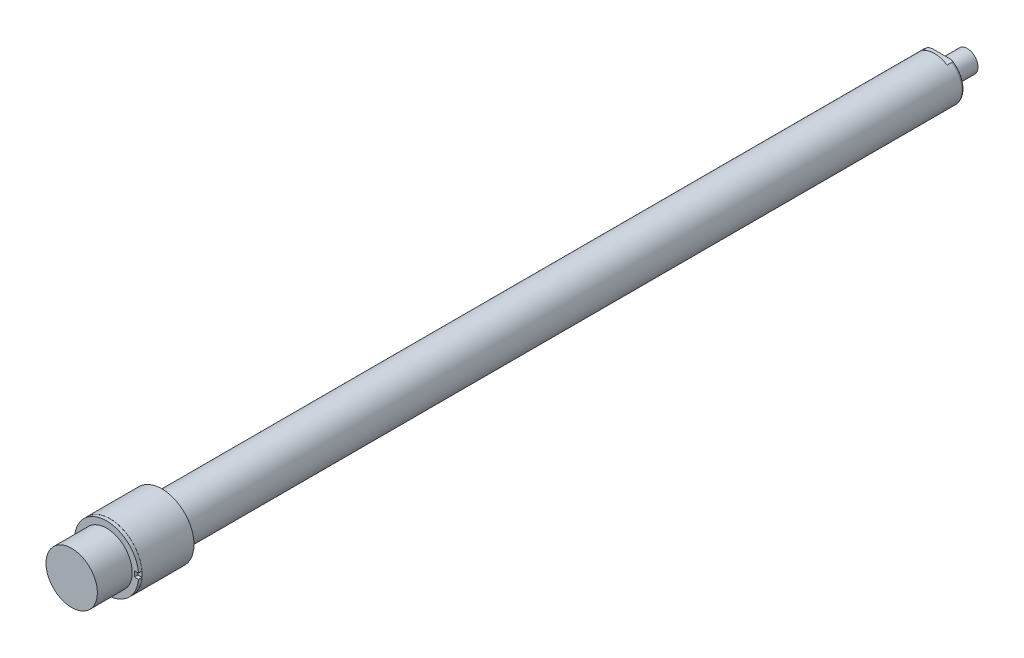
ISO-10303-21;
HEADER;
FILE_DESCRIPTION(('STEP AP214'),'2;1');
FILE_NAME('part.step','',(''),(''),'','','');
FILE_SCHEMA(('AUTOMOTIVE_DESIGN { 1 0 10303 214 1 1 1 1 }'));
ENDSEC;
DATA;
#1=APPLICATION_CONTEXT('core data for automotive mechanical design processes');
#2=APPLICATION_PROTOCOL_DEFINITION('international standard','automotive_design',2000,#1);
#3=PRODUCT_CONTEXT('',#1,'mechanical');
#4=PRODUCT('Part','Part','',(#3));
#5=PRODUCT_RELATED_PRODUCT_CATEGORY('part','',(#4));
#6=PRODUCT_DEFINITION_FORMATION('','',#4);
#7=PRODUCT_DEFINITION_CONTEXT('part definition',#1,'design');
#8=PRODUCT_DEFINITION('design','',#6,#7);
#9=PRODUCT_DEFINITION_SHAPE('','',#8);
#10=(LENGTH_UNIT() NAMED_UNIT(*) SI_UNIT(.MILLI.,.METRE.));
#11=(NAMED_UNIT(*) PLANE_ANGLE_UNIT() SI_UNIT($,.RADIAN.));
#12=(NAMED_UNIT(*) SI_UNIT($,.STERADIAN.) SOLID_ANGLE_UNIT());
#13=UNCERTAINTY_MEASURE_WITH_UNIT(LENGTH_MEASURE(1.E-05),#10,'distance_accuracy_value','');
#14=(GEOMETRIC_REPRESENTATION_CONTEXT(3) GLOBAL_UNCERTAINTY_ASSIGNED_CONTEXT((#13)) GLOBAL_UNIT_ASSIGNED_CONTEXT((#10,
#11,#12)) REPRESENTATION_CONTEXT('',''));
#15=CARTESIAN_POINT('',(0.,0.,0.));
#16=DIRECTION('',(0.,0.,1.));
#17=DIRECTION('',(1.,0.,0.));
#18=AXIS2_PLACEMENT_3D('',#15,#16,#17);
#19=CARTESIAN_POINT('',(-22.733,-2.032,13.0556));
#20=DIRECTION('',(0.,-1.,0.));
#21=DIRECTION('',(-1.,0.,0.));
#22=AXIS2_PLACEMENT_3D('',#19,#20,#21);
#23=PLANE('',#22);
#24=DIRECTION('',(1.,0.,0.));
#25=VECTOR('',#24,1.);
#26=CARTESIAN_POINT('',(0.,-2.032,10.6426));
#27=LINE('',#26,#25);
#28=CARTESIAN_POINT('',(-23.6236693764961,-2.032,10.6426));
#29=VERTEX_POINT('',#28);
#30=CARTESIAN_POINT('',(-20.574,-2.032,10.6426));
#31=VERTEX_POINT('',#30);
#32=EDGE_CURVE('E10',#29,#31,#27,.T.);
#33=ORIENTED_EDGE('',*,*,#32,.F.);
#34=DIRECTION('',(0.,0.,-1.));
#35=VECTOR('',#34,1.);
#36=CARTESIAN_POINT('',(-23.6236693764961,-2.032,13.182599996));
#37=LINE('',#36,#35);
#38=CARTESIAN_POINT('',(-23.6236693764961,-2.032,13.182599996));
#39=VERTEX_POINT('',#38);
#40=EDGE_CURVE('E296',#39,#29,#37,.T.);
#41=ORIENTED_EDGE('',*,*,#40,.F.);
#42=DIRECTION('',(-1.,0.,0.));
#43=VECTOR('',#42,1.);
#44=CARTESIAN_POINT('',(-20.574,-2.032,13.182599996));
#45=LINE('',#44,#43);
#46=CARTESIAN_POINT('',(-20.574,-2.032,13.182599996));
#47=VERTEX_POINT('',#46);
#48=EDGE_CURVE('E325',#47,#39,#45,.T.);
#49=ORIENTED_EDGE('',*,*,#48,.F.);
#50=DIRECTION('',(0.,0.,-1.));
#51=VECTOR('',#50,1.);
#52=CARTESIAN_POINT('',(-20.574,-2.032,13.0556));
#53=LINE('',#52,#51);
#54=EDGE_CURVE('E287',#47,#31,#53,.T.);
#55=ORIENTED_EDGE('',*,*,#54,.T.);
#56=EDGE_LOOP('',(#33,#41,#49,#55));
#57=FACE_BOUND('',#56,.T.);
#58=ADVANCED_FACE('F16',(#57),#23,.F.);
#59=CARTESIAN_POINT('',(0.,0.,-20.955));
#60=DIRECTION('',(0.,0.,-1.));
#61=DIRECTION('',(0.,-1.,0.));
#62=AXIS2_PLACEMENT_3D('',#59,#60,#61);
#63=CYLINDRICAL_SURFACE('',#62,23.7109);
#64=CARTESIAN_POINT('',(0.,0.,10.6426));
#65=DIRECTION('',(0.,0.,1.));
#66=DIRECTION('',(1.,0.,0.));
#67=AXIS2_PLACEMENT_3D('',#64,#65,#66);
#68=CIRCLE('',#67,23.7109);
#69=CARTESIAN_POINT('',(23.6236693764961,-2.032,10.6426));
#70=VERTEX_POINT('',#69);
#71=EDGE_CURVE('E27',#70,#29,#68,.F.);
#72=ORIENTED_EDGE('',*,*,#71,.F.);
#73=DIRECTION('',(0.,0.,-1.));
#74=VECTOR('',#73,1.);
#75=CARTESIAN_POINT('',(23.6236693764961,-2.032,13.182599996));
#76=LINE('',#75,#74);
#77=CARTESIAN_POINT('',(23.6236693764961,-2.032,13.182599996));
#78=VERTEX_POINT('',#77);
#79=EDGE_CURVE('E301',#78,#70,#76,.T.);
#80=ORIENTED_EDGE('',*,*,#79,.F.);
#81=CARTESIAN_POINT('',(0.,0.,13.182599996));
#82=DIRECTION('',(0.,0.,1.));
#83=DIRECTION('',(0.,1.,0.));
#84=AXIS2_PLACEMENT_3D('',#81,#82,#83);
#85=CIRCLE('',#84,23.7109);
#86=EDGE_CURVE('E323',#39,#78,#85,.T.);
#87=ORIENTED_EDGE('',*,*,#86,.F.);
#88=ORIENTED_EDGE('',*,*,#40,.T.);
#89=EDGE_LOOP('',(#72,#80,#87,#88));
#90=FACE_BOUND('',#89,.T.);
#91=ADVANCED_FACE('F243',(#90),#63,.T.);
#92=CARTESIAN_POINT('',(22.733,-2.032,13.0556));
#93=DIRECTION('',(0.,-1.,0.));
#94=DIRECTION('',(-1.,0.,0.));
#95=AXIS2_PLACEMENT_3D('',#92,#93,#94);
#96=PLANE('',#95);
#97=DIRECTION('',(1.,0.,0.));
#98=VECTOR('',#97,1.);
#99=CARTESIAN_POINT('',(0.,-2.032,10.6426));
#100=LINE('',#99,#98);
#101=CARTESIAN_POINT('',(20.574,-2.032,10.6426));
#102=VERTEX_POINT('',#101);
#103=EDGE_CURVE('E330',#102,#70,#100,.T.);
#104=ORIENTED_EDGE('',*,*,#103,.F.);
#105=DIRECTION('',(0.,0.,-1.));
#106=VECTOR('',#105,1.);
#107=CARTESIAN_POINT('',(20.574,-2.032,13.0556));
#108=LINE('',#107,#106);
#109=CARTESIAN_POINT('',(20.574,-2.032,13.182599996));
#110=VERTEX_POINT('',#109);
#111=EDGE_CURVE('E293',#110,#102,#108,.T.);
#112=ORIENTED_EDGE('',*,*,#111,.F.);
#113=DIRECTION('',(-1.,0.,0.));
#114=VECTOR('',#113,1.);
#115=CARTESIAN_POINT('',(23.6236693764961,-2.032,13.182599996));
#116=LINE('',#115,#114);
#117=EDGE_CURVE('E320',#78,#110,#116,.T.);
#118=ORIENTED_EDGE('',*,*,#117,.F.);
#119=ORIENTED_EDGE('',*,*,#79,.T.);
#120=EDGE_LOOP('',(#104,#112,#118,#119));
#121=FACE_BOUND('',#120,.T.);
#122=ADVANCED_FACE('F239',(#121),#96,.F.);
#123=CARTESIAN_POINT('',(20.574,-2.032,13.0556));
#124=DIRECTION('',(-1.,0.,0.));
#125=DIRECTION('',(0.,0.,-1.));
#126=AXIS2_PLACEMENT_3D('',#123,#124,#125);
#127=PLANE('',#126);
#128=DIRECTION('',(0.,-1.,0.));
#129=VECTOR('',#128,1.);
#130=CARTESIAN_POINT('',(20.574,0.,10.6426));
#131=LINE('',#130,#129);
#132=CARTESIAN_POINT('',(20.574,2.032,10.6426));
#133=VERTEX_POINT('',#132);
#134=EDGE_CURVE('E332',#133,#102,#131,.T.);
#135=ORIENTED_EDGE('',*,*,#134,.F.);
#136=DIRECTION('',(0.,0.,-1.));
#137=VECTOR('',#136,1.);
#138=CARTESIAN_POINT('',(20.574,2.032,13.0556));
#139=LINE('',#138,#137);
#140=CARTESIAN_POINT('',(20.574,2.032,13.182599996));
#141=VERTEX_POINT('',#140);
#142=EDGE_CURVE('E291',#141,#133,#139,.T.);
#143=ORIENTED_EDGE('',*,*,#142,.F.);
#144=DIRECTION('',(0.,1.,0.));
#145=VECTOR('',#144,1.);
#146=CARTESIAN_POINT('',(20.574,-2.032,13.182599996));
#147=LINE('',#146,#145);
#148=EDGE_CURVE('E317',#110,#141,#147,.T.);
#149=ORIENTED_EDGE('',*,*,#148,.F.);
#150=ORIENTED_EDGE('',*,*,#111,.T.);
#151=EDGE_LOOP('',(#135,#143,#149,#150));
#152=FACE_BOUND('',#151,.T.);
#153=ADVANCED_FACE('F235',(#152),#127,.F.);
#154=CARTESIAN_POINT('',(22.733,2.032,13.0556));
#155=DIRECTION('',(0.,1.,0.));
#156=DIRECTION('',(1.,0.,0.));
#157=AXIS2_PLACEMENT_3D('',#154,#155,#156);
#158=PLANE('',#157);
#159=DIRECTION('',(-1.,0.,0.));
#160=VECTOR('',#159,1.);
#161=CARTESIAN_POINT('',(0.,2.032,10.6426));
#162=LINE('',#161,#160);
#163=CARTESIAN_POINT('',(23.6236693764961,2.032,10.6426));
#164=VERTEX_POINT('',#163);
#165=EDGE_CURVE('E335',#164,#133,#162,.T.);
#166=ORIENTED_EDGE('',*,*,#165,.F.);
#167=DIRECTION('',(0.,0.,-1.));
#168=VECTOR('',#167,1.);
#169=CARTESIAN_POINT('',(23.6236693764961,2.032,13.182599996));
#170=LINE('',#169,#168);
#171=CARTESIAN_POINT('',(23.6236693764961,2.032,13.182599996));
#172=VERTEX_POINT('',#171);
#173=EDGE_CURVE('E304',#172,#164,#170,.T.);
#174=ORIENTED_EDGE('',*,*,#173,.F.);
#175=DIRECTION('',(1.,0.,0.));
#176=VECTOR('',#175,1.);
#177=CARTESIAN_POINT('',(20.574,2.032,13.182599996));
#178=LINE('',#177,#176);
#179=EDGE_CURVE('E315',#141,#172,#178,.T.);
#180=ORIENTED_EDGE('',*,*,#179,.F.);
#181=ORIENTED_EDGE('',*,*,#142,.T.);
#182=EDGE_LOOP('',(#166,#174,#180,#181));
#183=FACE_BOUND('',#182,.T.);
#184=ADVANCED_FACE('F238',(#183),#158,.F.);
#185=CARTESIAN_POINT('',(0.,0.,10.6426));
#186=DIRECTION('',(0.,0.,1.));
#187=DIRECTION('',(1.,0.,0.));
#188=AXIS2_PLACEMENT_3D('',#185,#186,#187);
#189=CIRCLE('',#188,23.7109);
#190=CARTESIAN_POINT('',(-23.6236693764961,2.032,10.6426));
#191=VERTEX_POINT('',#190);
#192=EDGE_CURVE('E338',#191,#164,#189,.F.);
#193=ORIENTED_EDGE('',*,*,#192,.F.);
#194=DIRECTION('',(0.,0.,-1.));
#195=VECTOR('',#194,1.);
#196=CARTESIAN_POINT('',(-23.6236693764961,2.032,13.182599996));
#197=LINE('',#196,#195);
#198=CARTESIAN_POINT('',(-23.6236693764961,2.032,13.182599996));
#199=VERTEX_POINT('',#198);
#200=EDGE_CURVE('E307',#199,#191,#197,.T.);
#201=ORIENTED_EDGE('',*,*,#200,.F.);
#202=CARTESIAN_POINT('',(0.,0.,13.182599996));
#203=DIRECTION('',(0.,0.,1.));
#204=DIRECTION('',(0.,1.,0.));
#205=AXIS2_PLACEMENT_3D('',#202,#203,#204);
#206=CIRCLE('',#205,23.7109);
#207=EDGE_CURVE('E313',#172,#199,#206,.T.);
#208=ORIENTED_EDGE('',*,*,#207,.F.);
#209=ORIENTED_EDGE('',*,*,#173,.T.);
#210=EDGE_LOOP('',(#193,#201,#208,#209));
#211=FACE_BOUND('',#210,.T.);
#212=ADVANCED_FACE('F247',(#211),#63,.T.);
#213=CARTESIAN_POINT('',(-22.733,2.032,13.0556));
#214=DIRECTION('',(0.,1.,0.));
#215=DIRECTION('',(1.,0.,0.));
#216=AXIS2_PLACEMENT_3D('',#213,#214,#215);
#217=PLANE('',#216);
#218=DIRECTION('',(-1.,0.,0.));
#219=VECTOR('',#218,1.);
#220=CARTESIAN_POINT('',(0.,2.032,10.6426));
#221=LINE('',#220,#219);
#222=CARTESIAN_POINT('',(-20.574,2.032,10.6426));
#223=VERTEX_POINT('',#222);
#224=EDGE_CURVE('E341',#223,#191,#221,.T.);
#225=ORIENTED_EDGE('',*,*,#224,.F.);
#226=DIRECTION('',(0.,0.,-1.));
#227=VECTOR('',#226,1.);
#228=CARTESIAN_POINT('',(-20.574,2.032,13.0556));
#229=LINE('',#228,#227);
#230=CARTESIAN_POINT('',(-20.574,2.032,13.182599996));
#231=VERTEX_POINT('',#230);
#232=EDGE_CURVE('E288',#231,#223,#229,.T.);
#233=ORIENTED_EDGE('',*,*,#232,.F.);
#234=DIRECTION('',(1.,0.,0.));
#235=VECTOR('',#234,1.);
#236=CARTESIAN_POINT('',(-23.6236693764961,2.032,13.182599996));
#237=LINE('',#236,#235);
#238=EDGE_CURVE('E310',#199,#231,#237,.T.);
#239=ORIENTED_EDGE('',*,*,#238,.F.);
#240=ORIENTED_EDGE('',*,*,#200,.T.);
#241=EDGE_LOOP('',(#225,#233,#239,#240));
#242=FACE_BOUND('',#241,.T.);
#243=ADVANCED_FACE('F251',(#242),#217,.F.);
#244=CARTESIAN_POINT('',(-20.574,2.032,13.0556));
#245=DIRECTION('',(1.,0.,0.));
#246=DIRECTION('',(0.,0.,1.));
#247=AXIS2_PLACEMENT_3D('',#244,#245,#246);
#248=PLANE('',#247);
#249=DIRECTION('',(0.,1.,0.));
#250=VECTOR('',#249,1.);
#251=CARTESIAN_POINT('',(-20.574,0.,10.6426));
#252=LINE('',#251,#250);
#253=EDGE_CURVE('E344',#31,#223,#252,.T.);
#254=ORIENTED_EDGE('',*,*,#253,.F.);
#255=ORIENTED_EDGE('',*,*,#54,.F.);
#256=DIRECTION('',(0.,-1.,0.));
#257=VECTOR('',#256,1.);
#258=CARTESIAN_POINT('',(-20.574,2.032,13.182599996));
#259=LINE('',#258,#257);
#260=EDGE_CURVE('E282',#231,#47,#259,.T.);
#261=ORIENTED_EDGE('',*,*,#260,.F.);
#262=ORIENTED_EDGE('',*,*,#232,.T.);
#263=EDGE_LOOP('',(#254,#255,#261,#262));
#264=FACE_BOUND('',#263,.T.);
#265=ADVANCED_FACE('F233',(#264),#248,.F.);
#266=CARTESIAN_POINT('',(0.,0.,13.182599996));
#267=DIRECTION('',(0.,0.,1.));
#268=DIRECTION('',(0.,1.,0.));
#269=AXIS2_PLACEMENT_3D('',#266,#267,#268);
#270=PLANE('',#269);
#271=CARTESIAN_POINT('',(0.,0.,13.182599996));
#272=DIRECTION('',(0.,0.,1.));
#273=DIRECTION('',(1.,0.,0.));
#274=AXIS2_PLACEMENT_3D('',#271,#272,#273);
#275=CIRCLE('',#274,19.);
#276=CARTESIAN_POINT('',(19.,0.,13.182599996));
#277=VERTEX_POINT('',#276);
#278=EDGE_CURVE('E283',#277,#277,#275,.F.);
#279=ORIENTED_EDGE('',*,*,#278,.T.);
#280=EDGE_LOOP('',(#279));
#281=FACE_BOUND('',#280,.T.);
#282=ORIENTED_EDGE('',*,*,#260,.T.);
#283=ORIENTED_EDGE('',*,*,#48,.T.);
#284=ORIENTED_EDGE('',*,*,#86,.T.);
#285=ORIENTED_EDGE('',*,*,#117,.T.);
#286=ORIENTED_EDGE('',*,*,#148,.T.);
#287=ORIENTED_EDGE('',*,*,#179,.T.);
#288=ORIENTED_EDGE('',*,*,#207,.T.);
#289=ORIENTED_EDGE('',*,*,#238,.T.);
#290=EDGE_LOOP('',(#282,#283,#284,#285,#286,#287,#288,#289));
#291=FACE_BOUND('',#290,.T.);
#292=ADVANCED_FACE('F220',(#281,#291),#270,.T.);
#293=CARTESIAN_POINT('',(0.,19.,39.));
#294=DIRECTION('',(0.,0.,-1.));
#295=DIRECTION('',(-1.,0.,0.));
#296=AXIS2_PLACEMENT_3D('',#293,#294,#295);
#297=PLANE('',#296);
#298=CARTESIAN_POINT('',(0.,0.,39.));
#299=DIRECTION('',(0.,0.,-1.));
#300=DIRECTION('',(-1.,0.,0.));
#301=AXIS2_PLACEMENT_3D('',#298,#299,#300);
#302=CIRCLE('',#301,19.);
#303=CARTESIAN_POINT('',(-19.,0.,39.));
#304=VERTEX_POINT('',#303);
#305=EDGE_CURVE('E125',#304,#304,#302,.T.);
#306=ORIENTED_EDGE('',*,*,#305,.F.);
#307=EDGE_LOOP('',(#306));
#308=FACE_BOUND('',#307,.T.);
#309=ADVANCED_FACE('F217',(#308),#297,.F.);
#310=CARTESIAN_POINT('',(0.,0.,-16.524));
#311=DIRECTION('',(0.,0.,-1.));
#312=DIRECTION('',(-1.,0.,0.));
#313=AXIS2_PLACEMENT_3D('',#310,#311,#312);
#314=CYLINDRICAL_SURFACE('',#313,19.);
#315=ORIENTED_EDGE('',*,*,#278,.F.);
#316=EDGE_LOOP('',(#315));
#317=FACE_BOUND('',#316,.T.);
#318=ORIENTED_EDGE('',*,*,#305,.T.);
#319=EDGE_LOOP('',(#318));
#320=FACE_BOUND('',#319,.T.);
#321=ADVANCED_FACE('F206',(#317,#320),#314,.T.);
#322=CARTESIAN_POINT('',(0.,0.,-27.686));
#323=DIRECTION('',(0.,0.,1.));
#324=DIRECTION('',(1.,0.,0.));
#325=AXIS2_PLACEMENT_3D('',#322,#323,#324);
#326=PLANE('',#325);
#327=CARTESIAN_POINT('',(0.,0.,-27.686));
#328=DIRECTION('',(0.,0.,1.));
#329=DIRECTION('',(1.,0.,0.));
#330=AXIS2_PLACEMENT_3D('',#327,#328,#329);
#331=CIRCLE('',#330,16.8);
#332=CARTESIAN_POINT('',(16.8,0.,-27.686));
#333=VERTEX_POINT('',#332);
#334=EDGE_CURVE('E347',#333,#333,#331,.T.);
#335=ORIENTED_EDGE('',*,*,#334,.T.);
#336=EDGE_LOOP('',(#335));
#337=FACE_BOUND('',#336,.T.);
#338=CARTESIAN_POINT('',(0.,0.,-27.686));
#339=DIRECTION('',(0.,0.,1.));
#340=DIRECTION('',(1.,0.,0.));
#341=AXIS2_PLACEMENT_3D('',#338,#339,#340);
#342=CIRCLE('',#341,23.8125);
#343=CARTESIAN_POINT('',(23.8125,0.,-27.686));
#344=VERTEX_POINT('',#343);
#345=EDGE_CURVE('E286',#344,#344,#342,.T.);
#346=ORIENTED_EDGE('',*,*,#345,.F.);
#347=EDGE_LOOP('',(#346));
#348=FACE_BOUND('',#347,.T.);
#349=ADVANCED_FACE('F203',(#337,#348),#326,.F.);
#350=CARTESIAN_POINT('',(0.,0.,-23.495));
#351=DIRECTION('',(0.,0.,-1.));
#352=DIRECTION('',(-1.,0.,0.));
#353=AXIS2_PLACEMENT_3D('',#350,#351,#352);
#354=CYLINDRICAL_SURFACE('',#353,16.8);
#355=ORIENTED_EDGE('',*,*,#334,.F.);
#356=EDGE_LOOP('',(#355));
#357=FACE_BOUND('',#356,.T.);
#358=DIRECTION('',(0.,0.,-1.));
#359=VECTOR('',#358,1.);
#360=CARTESIAN_POINT('',(-9.28654941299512,14.,-599.4654));
#361=LINE('',#360,#359);
#362=CARTESIAN_POINT('',(-9.28654941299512,14.,-599.4654));
#363=VERTEX_POINT('',#362);
#364=CARTESIAN_POINT('',(-9.28654941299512,14.,-602.9579));
#365=VERTEX_POINT('',#364);
#366=EDGE_CURVE('E116',#363,#365,#361,.T.);
#367=ORIENTED_EDGE('',*,*,#366,.T.);
#368=CARTESIAN_POINT('',(0.,0.,-602.9579));
#369=DIRECTION('',(0.,0.,-1.));
#370=DIRECTION('',(-1.,0.,0.));
#371=AXIS2_PLACEMENT_3D('',#368,#369,#370);
#372=CIRCLE('',#371,16.8);
#373=CARTESIAN_POINT('',(-9.28654941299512,-14.,-602.9579));
#374=VERTEX_POINT('',#373);
#375=EDGE_CURVE('E138',#374,#365,#372,.T.);
#376=ORIENTED_EDGE('',*,*,#375,.F.);
#377=DIRECTION('',(0.,0.,-1.));
#378=VECTOR('',#377,1.);
#379=CARTESIAN_POINT('',(-9.28654941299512,-14.,-599.4654));
#380=LINE('',#379,#378);
#381=CARTESIAN_POINT('',(-9.28654941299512,-14.,-599.4654));
#382=VERTEX_POINT('',#381);
#383=EDGE_CURVE('E178',#382,#374,#380,.T.);
#384=ORIENTED_EDGE('',*,*,#383,.F.);
#385=CARTESIAN_POINT('',(0.,0.,-599.4654));
#386=DIRECTION('',(0.,0.,-1.));
#387=DIRECTION('',(-1.,0.,0.));
#388=AXIS2_PLACEMENT_3D('',#385,#386,#387);
#389=CIRCLE('',#388,16.8);
#390=CARTESIAN_POINT('',(9.28654941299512,-14.,-599.4654));
#391=VERTEX_POINT('',#390);
#392=EDGE_CURVE('E146',#391,#382,#389,.T.);
#393=ORIENTED_EDGE('',*,*,#392,.F.);
#394=DIRECTION('',(0.,0.,-1.));
#395=VECTOR('',#394,1.);
#396=CARTESIAN_POINT('',(9.28654941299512,-14.,-599.4654));
#397=LINE('',#396,#395);
#398=CARTESIAN_POINT('',(9.28654941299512,-14.,-602.9579));
#399=VERTEX_POINT('',#398);
#400=EDGE_CURVE('E177',#391,#399,#397,.T.);
#401=ORIENTED_EDGE('',*,*,#400,.T.);
#402=CARTESIAN_POINT('',(9.28654941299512,14.,-602.9579));
#403=VERTEX_POINT('',#402);
#404=EDGE_CURVE('E132',#403,#399,#372,.T.);
#405=ORIENTED_EDGE('',*,*,#404,.F.);
#406=DIRECTION('',(0.,0.,-1.));
#407=VECTOR('',#406,1.);
#408=CARTESIAN_POINT('',(9.28654941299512,14.,-599.4654));
#409=LINE('',#408,#407);
#410=CARTESIAN_POINT('',(9.28654941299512,14.,-599.4654));
#411=VERTEX_POINT('',#410);
#412=EDGE_CURVE('E111',#411,#403,#409,.T.);
#413=ORIENTED_EDGE('',*,*,#412,.F.);
#414=CARTESIAN_POINT('',(0.,0.,-599.4654));
#415=DIRECTION('',(0.,0.,-1.));
#416=DIRECTION('',(-1.,0.,0.));
#417=AXIS2_PLACEMENT_3D('',#414,#415,#416);
#418=CIRCLE('',#417,16.8);
#419=EDGE_CURVE('E274',#363,#411,#418,.T.);
#420=ORIENTED_EDGE('',*,*,#419,.F.);
#421=EDGE_LOOP('',(#367,#376,#384,#393,#401,#405,#413,#420));
#422=FACE_BOUND('',#421,.T.);
#423=ADVANCED_FACE('F205',(#357,#422),#354,.T.);
#424=CARTESIAN_POINT('',(0.,0.,10.6426));
#425=DIRECTION('',(0.,0.,-1.));
#426=DIRECTION('',(-1.,0.,0.));
#427=AXIS2_PLACEMENT_3D('',#424,#425,#426);
#428=CYLINDRICAL_SURFACE('',#427,23.8125);
#429=CARTESIAN_POINT('',(0.,0.,10.6426));
#430=DIRECTION('',(0.,0.,1.));
#431=DIRECTION('',(1.,0.,0.));
#432=AXIS2_PLACEMENT_3D('',#429,#430,#431);
#433=CIRCLE('',#432,23.8125);
#434=CARTESIAN_POINT('',(23.8125,0.,10.6426));
#435=VERTEX_POINT('',#434);
#436=EDGE_CURVE('E349',#435,#435,#433,.T.);
#437=ORIENTED_EDGE('',*,*,#436,.F.);
#438=EDGE_LOOP('',(#437));
#439=FACE_BOUND('',#438,.T.);
#440=ORIENTED_EDGE('',*,*,#345,.T.);
#441=EDGE_LOOP('',(#440));
#442=FACE_BOUND('',#441,.T.);
#443=ADVANCED_FACE('F214',(#439,#442),#428,.T.);
#444=CARTESIAN_POINT('',(0.,0.,10.6426));
#445=DIRECTION('',(0.,0.,1.));
#446=DIRECTION('',(1.,0.,0.));
#447=AXIS2_PLACEMENT_3D('',#444,#445,#446);
#448=PLANE('',#447);
#449=ORIENTED_EDGE('',*,*,#436,.T.);
#450=EDGE_LOOP('',(#449));
#451=FACE_BOUND('',#450,.T.);
#452=ORIENTED_EDGE('',*,*,#71,.T.);
#453=ORIENTED_EDGE('',*,*,#32,.T.);
#454=ORIENTED_EDGE('',*,*,#253,.T.);
#455=ORIENTED_EDGE('',*,*,#224,.T.);
#456=ORIENTED_EDGE('',*,*,#192,.T.);
#457=ORIENTED_EDGE('',*,*,#165,.T.);
#458=ORIENTED_EDGE('',*,*,#134,.T.);
#459=ORIENTED_EDGE('',*,*,#103,.T.);
#460=EDGE_LOOP('',(#452,#453,#454,#455,#456,#457,#458,#459));
#461=FACE_BOUND('',#460,.T.);
#462=ADVANCED_FACE('F224',(#451,#461),#448,.T.);
#463=CARTESIAN_POINT('',(0.,8.,-623.5954));
#464=DIRECTION('',(0.,0.,-1.));
#465=DIRECTION('',(-1.,0.,0.));
#466=AXIS2_PLACEMENT_3D('',#463,#464,#465);
#467=PLANE('',#466);
#468=CARTESIAN_POINT('',(0.,0.,-623.5954));
#469=DIRECTION('',(0.,0.,-1.));
#470=DIRECTION('',(-1.,0.,0.));
#471=AXIS2_PLACEMENT_3D('',#468,#469,#470);
#472=CIRCLE('',#471,8.);
#473=CARTESIAN_POINT('',(-8.,0.,-623.5954));
#474=VERTEX_POINT('',#473);
#475=EDGE_CURVE('E180',#474,#474,#472,.T.);
#476=ORIENTED_EDGE('',*,*,#475,.T.);
#477=EDGE_LOOP('',(#476));
#478=FACE_BOUND('',#477,.T.);
#479=ADVANCED_FACE('F169',(#478),#467,.T.);
#480=CARTESIAN_POINT('',(0.,0.,-623.5954));
#481=DIRECTION('',(0.,0.,-1.));
#482=DIRECTION('',(-1.,0.,0.));
#483=AXIS2_PLACEMENT_3D('',#480,#481,#482);
#484=CYLINDRICAL_SURFACE('',#483,8.);
#485=CARTESIAN_POINT('',(0.,0.,-607.0854));
#486=DIRECTION('',(0.,0.,-1.));
#487=DIRECTION('',(-1.,0.,0.));
#488=AXIS2_PLACEMENT_3D('',#485,#486,#487);
#489=CIRCLE('',#488,8.);
#490=CARTESIAN_POINT('',(-8.,0.,-607.0854));
#491=VERTEX_POINT('',#490);
#492=EDGE_CURVE('E183',#491,#491,#489,.T.);
#493=ORIENTED_EDGE('',*,*,#492,.T.);
#494=EDGE_LOOP('',(#493));
#495=FACE_BOUND('',#494,.T.);
#496=ORIENTED_EDGE('',*,*,#475,.F.);
#497=EDGE_LOOP('',(#496));
#498=FACE_BOUND('',#497,.T.);
#499=ADVANCED_FACE('F201',(#495,#498),#484,.T.);
#500=CARTESIAN_POINT('',(0.,6.858,-607.0854));
#501=DIRECTION('',(0.,0.,1.));
#502=DIRECTION('',(1.,0.,0.));
#503=AXIS2_PLACEMENT_3D('',#500,#501,#502);
#504=PLANE('',#503);
#505=CARTESIAN_POINT('',(0.,0.,-607.0854));
#506=DIRECTION('',(0.,0.,-1.));
#507=DIRECTION('',(-1.,0.,0.));
#508=AXIS2_PLACEMENT_3D('',#505,#506,#507);
#509=CIRCLE('',#508,6.858);
#510=CARTESIAN_POINT('',(-6.858,0.,-607.0854));
#511=VERTEX_POINT('',#510);
#512=EDGE_CURVE('E134',#511,#511,#509,.T.);
#513=ORIENTED_EDGE('',*,*,#512,.T.);
#514=EDGE_LOOP('',(#513));
#515=FACE_BOUND('',#514,.T.);
#516=ORIENTED_EDGE('',*,*,#492,.F.);
#517=EDGE_LOOP('',(#516));
#518=FACE_BOUND('',#517,.T.);
#519=ADVANCED_FACE('F188',(#515,#518),#504,.T.);
#520=CARTESIAN_POINT('',(0.,0.,-623.5954));
#521=DIRECTION('',(0.,0.,-1.));
#522=DIRECTION('',(-1.,0.,0.));
#523=AXIS2_PLACEMENT_3D('',#520,#521,#522);
#524=CYLINDRICAL_SURFACE('',#523,6.858);
#525=CARTESIAN_POINT('',(0.,0.,-604.5454));
#526=DIRECTION('',(0.,0.,-1.));
#527=DIRECTION('',(-1.,0.,0.));
#528=AXIS2_PLACEMENT_3D('',#525,#526,#527);
#529=CIRCLE('',#528,6.858);
#530=CARTESIAN_POINT('',(-6.858,0.,-604.5454));
#531=VERTEX_POINT('',#530);
#532=EDGE_CURVE('E130',#531,#531,#529,.T.);
#533=ORIENTED_EDGE('',*,*,#532,.T.);
#534=EDGE_LOOP('',(#533));
#535=FACE_BOUND('',#534,.T.);
#536=ORIENTED_EDGE('',*,*,#512,.F.);
#537=EDGE_LOOP('',(#536));
#538=FACE_BOUND('',#537,.T.);
#539=ADVANCED_FACE('F191',(#535,#538),#524,.T.);
#540=CARTESIAN_POINT('',(0.,15.2125,-604.5454));
#541=DIRECTION('',(0.,0.,-1.));
#542=DIRECTION('',(-1.,0.,0.));
#543=AXIS2_PLACEMENT_3D('',#540,#541,#542);
#544=PLANE('',#543);
#545=DIRECTION('',(-1.,0.,0.));
#546=VECTOR('',#545,1.);
#547=CARTESIAN_POINT('',(0.,14.,-604.5454));
#548=LINE('',#547,#546);
#549=CARTESIAN_POINT('',(5.95148353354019,14.,-604.5454));
#550=VERTEX_POINT('',#549);
#551=CARTESIAN_POINT('',(-5.95148353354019,14.,-604.5454));
#552=VERTEX_POINT('',#551);
#553=EDGE_CURVE('E21',#550,#552,#548,.T.);
#554=ORIENTED_EDGE('',*,*,#553,.F.);
#555=CARTESIAN_POINT('',(0.,0.,-604.5454));
#556=DIRECTION('',(0.,0.,-1.));
#557=DIRECTION('',(-1.,0.,0.));
#558=AXIS2_PLACEMENT_3D('',#555,#556,#557);
#559=CIRCLE('',#558,15.2125);
#560=CARTESIAN_POINT('',(5.95148353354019,-14.,-604.5454));
#561=VERTEX_POINT('',#560);
#562=EDGE_CURVE('E122',#550,#561,#559,.T.);
#563=ORIENTED_EDGE('',*,*,#562,.T.);
#564=DIRECTION('',(1.,0.,0.));
#565=VECTOR('',#564,1.);
#566=CARTESIAN_POINT('',(0.,-14.,-604.5454));
#567=LINE('',#566,#565);
#568=CARTESIAN_POINT('',(-5.95148353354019,-14.,-604.5454));
#569=VERTEX_POINT('',#568);
#570=EDGE_CURVE('E126',#569,#561,#567,.T.);
#571=ORIENTED_EDGE('',*,*,#570,.F.);
#572=EDGE_CURVE('E124',#569,#552,#559,.T.);
#573=ORIENTED_EDGE('',*,*,#572,.T.);
#574=EDGE_LOOP('',(#554,#563,#571,#573));
#575=FACE_BOUND('',#574,.T.);
#576=ORIENTED_EDGE('',*,*,#532,.F.);
#577=EDGE_LOOP('',(#576));
#578=FACE_BOUND('',#577,.T.);
#579=ADVANCED_FACE('F120',(#575,#578),#544,.T.);
#580=CARTESIAN_POINT('',(0.,0.,-599.4654));
#581=DIRECTION('',(0.,0.,-1.));
#582=DIRECTION('',(-1.,0.,0.));
#583=AXIS2_PLACEMENT_3D('',#580,#581,#582);
#584=PLANE('',#583);
#585=ORIENTED_EDGE('',*,*,#419,.T.);
#586=DIRECTION('',(-1.,0.,0.));
#587=VECTOR('',#586,1.);
#588=CARTESIAN_POINT('',(9.28654941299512,14.,-599.4654));
#589=LINE('',#588,#587);
#590=EDGE_CURVE('E275',#411,#363,#589,.T.);
#591=ORIENTED_EDGE('',*,*,#590,.T.);
#592=EDGE_LOOP('',(#585,#591));
#593=FACE_BOUND('',#592,.T.);
#594=ADVANCED_FACE('F161',(#593),#584,.T.);
#595=CARTESIAN_POINT('',(0.,0.,-602.9579));
#596=DIRECTION('',(0.,0.,-1.));
#597=DIRECTION('',(-1.,0.,0.));
#598=AXIS2_PLACEMENT_3D('',#595,#596,#597);
#599=TOROIDAL_SURFACE('',#598,15.2125,1.5875);
#600=CARTESIAN_POINT('',(0.,14.,-603.982595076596));
#601=CARTESIAN_POINT('',(-0.132768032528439,14.,-603.982593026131));
#602=CARTESIAN_POINT('',(-0.26553369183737,14.,-603.984844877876));
#603=CARTESIAN_POINT('',(-0.530924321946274,14.,-603.993671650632));
#604=CARTESIAN_POINT('',(-0.663549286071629,14.,-604.000246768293));
#605=CARTESIAN_POINT('',(-1.06113740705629,14.,-604.02582076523));
#606=CARTESIAN_POINT('',(-1.32572041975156,14.,-604.050667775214));
#607=CARTESIAN_POINT('',(-1.85467558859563,14.,-604.110304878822));
#608=CARTESIAN_POINT('',(-2.11904315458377,14.,-604.14513225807));
#609=CARTESIAN_POINT('',(-2.64722640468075,14.,-604.218362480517));
#610=CARTESIAN_POINT('',(-2.91104215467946,14.,-604.25676486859));
#611=CARTESIAN_POINT('',(-3.34668840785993,14.,-604.318564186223));
#612=CARTESIAN_POINT('',(-3.51843693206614,14.,-604.34251393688));
#613=CARTESIAN_POINT('',(-3.86222256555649,14.,-604.38822682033));
#614=CARTESIAN_POINT('',(-4.0342596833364,14.,-604.409989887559));
#615=CARTESIAN_POINT('',(-4.55096879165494,14.,-604.470020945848));
#616=CARTESIAN_POINT('',(-4.89633775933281,14.,-604.503046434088));
#617=CARTESIAN_POINT('',(-5.43248455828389,14.,-604.534635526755));
#618=CARTESIAN_POINT('',(-5.62271612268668,14.,-604.542024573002));
#619=CARTESIAN_POINT('',(-6.00342493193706,14.,-604.546964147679));
#620=CARTESIAN_POINT('',(-6.19390224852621,14.,-604.544510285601));
#621=CARTESIAN_POINT('',(-6.57443040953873,14.,-604.52706589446));
#622=CARTESIAN_POINT('',(-6.76448114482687,14.,-604.512072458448));
#623=CARTESIAN_POINT('',(-7.04800150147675,14.,-604.477528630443));
#624=CARTESIAN_POINT('',(-7.14221305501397,14.,-604.464012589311));
#625=CARTESIAN_POINT('',(-7.32985530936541,14.,-604.432394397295));
#626=CARTESIAN_POINT('',(-7.42328618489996,14.,-604.414293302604));
#627=CARTESIAN_POINT('',(-7.60981224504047,14.,-604.372657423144));
#628=CARTESIAN_POINT('',(-7.70289714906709,14.,-604.349075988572));
#629=CARTESIAN_POINT('',(-7.88726094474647,14.,-604.29574825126));
#630=CARTESIAN_POINT('',(-7.97854070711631,14.,-604.26600500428));
#631=CARTESIAN_POINT('',(-8.15800808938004,14.,-604.199496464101));
#632=CARTESIAN_POINT('',(-8.24620915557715,14.,-604.162767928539));
#633=CARTESIAN_POINT('',(-8.41861308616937,14.,-604.080991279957));
#634=CARTESIAN_POINT('',(-8.50282110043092,14.,-604.035954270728));
#635=CARTESIAN_POINT('',(-8.64739637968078,14.,-603.947038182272));
#636=CARTESIAN_POINT('',(-8.70893575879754,14.,-603.905080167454));
#637=CARTESIAN_POINT('',(-8.82695536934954,14.,-603.814330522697));
#638=CARTESIAN_POINT('',(-8.88342980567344,14.,-603.765531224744));
#639=CARTESIAN_POINT('',(-8.98963579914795,14.,-603.659856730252));
#640=CARTESIAN_POINT('',(-9.03928619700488,14.,-603.602898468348));
#641=CARTESIAN_POINT('',(-9.12777987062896,14.,-603.4811116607));
#642=CARTESIAN_POINT('',(-9.16665238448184,14.,-603.41630510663));
#643=CARTESIAN_POINT('',(-9.22003745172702,14.,-603.300711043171));
#644=CARTESIAN_POINT('',(-9.238363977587,14.,-603.251688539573));
#645=CARTESIAN_POINT('',(-9.2666325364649,14.,-603.151274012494));
#646=CARTESIAN_POINT('',(-9.27658176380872,14.,-603.09988406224));
#647=CARTESIAN_POINT('',(-9.28727482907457,14.,-602.99594216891));
#648=CARTESIAN_POINT('',(-9.28798383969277,14.,-602.94338657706));
#649=CARTESIAN_POINT('',(-9.28004044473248,14.,-602.83898713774));
#650=CARTESIAN_POINT('',(-9.27138562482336,14.,-602.787143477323));
#651=CARTESIAN_POINT('',(-9.24609238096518,14.,-602.688096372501));
#652=CARTESIAN_POINT('',(-9.22985055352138,14.,-602.640789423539));
#653=CARTESIAN_POINT('',(-9.19066177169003,14.,-602.549071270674));
#654=CARTESIAN_POINT('',(-9.16771223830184,14.,-602.504661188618));
#655=CARTESIAN_POINT('',(-9.10285320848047,14.,-602.396841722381));
#656=CARTESIAN_POINT('',(-9.05730159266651,14.,-602.335624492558));
#657=CARTESIAN_POINT('',(-8.95711629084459,14.,-602.22113877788));
#658=CARTESIAN_POINT('',(-8.90245884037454,14.,-602.167891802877));
#659=CARTESIAN_POINT('',(-8.75205778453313,14.,-602.038960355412));
#660=CARTESIAN_POINT('',(-8.65138838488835,14.,-601.969065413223));
#661=CARTESIAN_POINT('',(-8.44094705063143,14.,-601.844906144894));
#662=CARTESIAN_POINT('',(-8.33115456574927,14.,-601.790678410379));
#663=CARTESIAN_POINT('',(-8.11312892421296,14.,-601.697886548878));
#664=CARTESIAN_POINT('',(-8.0052101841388,14.,-601.658567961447));
#665=CARTESIAN_POINT('',(-7.78638225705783,14.,-601.589218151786));
#666=CARTESIAN_POINT('',(-7.67547044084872,14.,-601.55919540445));
#667=CARTESIAN_POINT('',(-7.45172845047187,14.,-601.50694530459));
#668=CARTESIAN_POINT('',(-7.33889625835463,14.,-601.484726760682));
#669=CARTESIAN_POINT('',(-7.11210332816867,14.,-601.446935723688));
#670=CARTESIAN_POINT('',(-6.99814217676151,14.,-601.431365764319));
#671=CARTESIAN_POINT('',(-6.76357841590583,14.,-601.405250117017));
#672=CARTESIAN_POINT('',(-6.64294221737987,14.,-601.395012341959));
#673=CARTESIAN_POINT('',(-6.40132401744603,14.,-601.379929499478));
#674=CARTESIAN_POINT('',(-6.28034194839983,14.,-601.37508557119));
#675=CARTESIAN_POINT('',(-5.91706739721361,14.,-601.367460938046));
#676=CARTESIAN_POINT('',(-5.67462782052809,14.,-601.371605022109));
#677=CARTESIAN_POINT('',(-5.18958172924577,14.,-601.393383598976));
#678=CARTESIAN_POINT('',(-4.94697788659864,14.,-601.411067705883));
#679=CARTESIAN_POINT('',(-4.46281479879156,14.,-601.455899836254));
#680=CARTESIAN_POINT('',(-4.22125506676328,14.,-601.483042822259));
#681=CARTESIAN_POINT('',(-3.66652722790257,14.,-601.552108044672));
#682=CARTESIAN_POINT('',(-3.35361868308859,14.,-601.59602115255));
#683=CARTESIAN_POINT('',(-2.72786060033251,14.,-601.68538682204));
#684=CARTESIAN_POINT('',(-2.4150112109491,14.,-601.730840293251));
#685=CARTESIAN_POINT('',(-1.79091906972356,14.,-601.813284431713));
#686=CARTESIAN_POINT('',(-1.47968696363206,14.,-601.850347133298));
#687=CARTESIAN_POINT('',(-1.01173384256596,14.,-601.892283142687));
#688=CARTESIAN_POINT('',(-0.855647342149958,14.,-601.903982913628));
#689=CARTESIAN_POINT('',(-0.543154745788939,14.,-601.921808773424));
#690=CARTESIAN_POINT('',(-0.386748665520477,14.,-601.927935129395));
#691=CARTESIAN_POINT('',(-0.0729452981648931,14.,-601.934018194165));
#692=CARTESIAN_POINT('',(0.0844526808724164,14.,-601.933940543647));
#693=CARTESIAN_POINT('',(0.399120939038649,14.,-601.927538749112));
#694=CARTESIAN_POINT('',(0.556391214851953,14.,-601.921214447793));
#695=CARTESIAN_POINT('',(0.8707473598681,14.,-601.902945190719));
#696=CARTESIAN_POINT('',(1.02783290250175,14.,-601.890994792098));
#697=CARTESIAN_POINT('',(1.3415973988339,14.,-601.862550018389));
#698=CARTESIAN_POINT('',(1.4982763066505,14.,-601.846055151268));
#699=CARTESIAN_POINT('',(1.81316576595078,14.,-601.809583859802));
#700=CARTESIAN_POINT('',(1.97137154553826,14.,-601.789567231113));
#701=CARTESIAN_POINT('',(2.28750928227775,14.,-601.747537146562));
#702=CARTESIAN_POINT('',(2.44544124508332,14.,-601.725523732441));
#703=CARTESIAN_POINT('',(2.91891159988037,14.,-601.658449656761));
#704=CARTESIAN_POINT('',(3.23429351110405,14.,-601.612332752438));
#705=CARTESIAN_POINT('',(3.8669692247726,14.,-601.526141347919));
#706=CARTESIAN_POINT('',(4.18426592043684,14.,-601.48608632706));
#707=CARTESIAN_POINT('',(4.66160221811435,14.,-601.436907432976));
#708=CARTESIAN_POINT('',(4.82106369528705,14.,-601.422325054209));
#709=CARTESIAN_POINT('',(5.14034359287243,14.,-601.397922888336));
#710=CARTESIAN_POINT('',(5.30016197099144,14.,-601.388102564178));
#711=CARTESIAN_POINT('',(5.61795638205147,14.,-601.374521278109));
#712=CARTESIAN_POINT('',(5.77592887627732,14.,-601.370682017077));
#713=CARTESIAN_POINT('',(6.09195057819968,14.,-601.37014758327));
#714=CARTESIAN_POINT('',(6.24999979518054,14.,-601.373454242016));
#715=CARTESIAN_POINT('',(6.56527224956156,14.,-601.388786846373));
#716=CARTESIAN_POINT('',(6.72249656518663,14.,-601.400789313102));
#717=CARTESIAN_POINT('',(7.03573124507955,14.,-601.435441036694));
#718=CARTESIAN_POINT('',(7.1917424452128,14.,-601.458082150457));
#719=CARTESIAN_POINT('',(7.41615197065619,14.,-601.500489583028));
#720=CARTESIAN_POINT('',(7.48555710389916,14.,-601.514991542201));
#721=CARTESIAN_POINT('',(7.62369369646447,14.,-601.546975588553));
#722=CARTESIAN_POINT('',(7.6924250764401,14.,-601.564458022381));
#723=CARTESIAN_POINT('',(7.82924857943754,14.,-601.602814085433));
#724=CARTESIAN_POINT('',(7.89733687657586,14.,-601.623701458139));
#725=CARTESIAN_POINT('',(8.03225786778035,14.,-601.669211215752));
#726=CARTESIAN_POINT('',(8.09909066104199,14.,-601.693833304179));
#727=CARTESIAN_POINT('',(8.23194606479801,14.,-601.747631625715));
#728=CARTESIAN_POINT('',(8.29794618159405,14.,-601.776863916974));
#729=CARTESIAN_POINT('',(8.42761843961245,14.,-601.840218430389));
#730=CARTESIAN_POINT('',(8.49128951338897,14.,-601.874342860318));
#731=CARTESIAN_POINT('',(8.61506191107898,14.,-601.94792848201));
#732=CARTESIAN_POINT('',(8.67517993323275,14.,-601.987361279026));
#733=CARTESIAN_POINT('',(8.79087032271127,14.,-602.072343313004));
#734=CARTESIAN_POINT('',(8.84644896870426,14.,-602.117883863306));
#735=CARTESIAN_POINT('',(8.94548291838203,14.,-602.210317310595));
#736=CARTESIAN_POINT('',(8.98959902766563,14.,-602.256494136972));
#737=CARTESIAN_POINT('',(9.07112763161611,14.,-602.354534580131));
#738=CARTESIAN_POINT('',(9.10853908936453,14.,-602.406399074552));
#739=CARTESIAN_POINT('',(9.17478487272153,14.,-602.516313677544));
#740=CARTESIAN_POINT('',(9.20351043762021,14.,-602.574430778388));
#741=CARTESIAN_POINT('',(9.24908813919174,14.,-602.695152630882));
#742=CARTESIAN_POINT('',(9.26596285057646,14.,-602.757748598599));
#743=CARTESIAN_POINT('',(9.28464960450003,14.,-602.877335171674));
#744=CARTESIAN_POINT('',(9.288049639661,14.,-602.93407661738));
#745=CARTESIAN_POINT('',(9.28382966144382,14.,-603.047145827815));
#746=CARTESIAN_POINT('',(9.27621073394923,14.,-603.103473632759));
#747=CARTESIAN_POINT('',(9.2522900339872,14.,-603.207102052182));
#748=CARTESIAN_POINT('',(9.23713577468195,14.,-603.254676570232));
#749=CARTESIAN_POINT('',(9.19997892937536,14.,-603.347038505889));
#750=CARTESIAN_POINT('',(9.17797466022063,14.,-603.391825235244));
#751=CARTESIAN_POINT('',(9.11609014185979,14.,-603.499302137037));
#752=CARTESIAN_POINT('',(9.0727369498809,14.,-603.559990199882));
#753=CARTESIAN_POINT('',(8.97697606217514,14.,-603.673741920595));
#754=CARTESIAN_POINT('',(8.92454537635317,14.,-603.726785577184));
#755=CARTESIAN_POINT('',(8.78073012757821,14.,-603.854735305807));
#756=CARTESIAN_POINT('',(8.6845428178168,14.,-603.924202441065));
#757=CARTESIAN_POINT('',(8.48303059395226,14.,-604.048115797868));
#758=CARTESIAN_POINT('',(8.37768429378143,14.,-604.102525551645));
#759=CARTESIAN_POINT('',(8.16908427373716,14.,-604.195673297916));
#760=CARTESIAN_POINT('',(8.06619117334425,14.,-604.235235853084));
#761=CARTESIAN_POINT('',(7.85737031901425,14.,-604.305483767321));
#762=CARTESIAN_POINT('',(7.75143986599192,14.,-604.336160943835));
#763=CARTESIAN_POINT('',(7.53762663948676,14.,-604.390024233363));
#764=CARTESIAN_POINT('',(7.42974224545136,14.,-604.413203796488));
#765=CARTESIAN_POINT('',(7.2128718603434,14.,-604.453141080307));
#766=CARTESIAN_POINT('',(7.10388648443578,14.,-604.469902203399));
#767=CARTESIAN_POINT('',(6.8913021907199,14.,-604.497143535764));
#768=CARTESIAN_POINT('',(6.78774054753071,14.,-604.507921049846));
#769=CARTESIAN_POINT('',(6.58025497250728,14.,-604.525196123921));
#770=CARTESIAN_POINT('',(6.47633098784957,14.,-604.531693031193));
#771=CARTESIAN_POINT('',(6.16416768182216,14.,-604.545589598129));
#772=CARTESIAN_POINT('',(5.95567421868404,14.,-604.547379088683));
#773=CARTESIAN_POINT('',(5.53835436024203,14.,-604.53950473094));
#774=CARTESIAN_POINT('',(5.32952888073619,14.,-604.529806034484));
#775=CARTESIAN_POINT('',(4.9124339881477,14.,-604.501724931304));
#776=CARTESIAN_POINT('',(4.70416474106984,14.,-604.483340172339));
#777=CARTESIAN_POINT('',(4.28654719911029,14.,-604.440186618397));
#778=CARTESIAN_POINT('',(4.07720452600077,14.,-604.415365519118));
#779=CARTESIAN_POINT('',(3.65905089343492,14.,-604.361814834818));
#780=CARTESIAN_POINT('',(3.45023989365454,14.,-604.333085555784));
#781=CARTESIAN_POINT('',(3.03316786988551,14.,-604.274210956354));
#782=CARTESIAN_POINT('',(2.82490650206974,14.,-604.244067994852));
#783=CARTESIAN_POINT('',(2.40822602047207,14.,-604.184971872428));
#784=CARTESIAN_POINT('',(2.19980692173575,14.,-604.156018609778));
#785=CARTESIAN_POINT('',(1.82558056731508,14.,-604.107810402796));
#786=CARTESIAN_POINT('',(1.65987471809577,14.,-604.087788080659));
#787=CARTESIAN_POINT('',(1.32795613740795,14.,-604.051904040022));
#788=CARTESIAN_POINT('',(1.1617432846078,14.,-604.036043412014));
#789=CARTESIAN_POINT('',(0.829734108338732,14.,-604.010025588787));
#790=CARTESIAN_POINT('',(0.663940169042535,14.,-603.999838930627));
#791=CARTESIAN_POINT('',(0.332096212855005,14.,-603.986125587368));
#792=CARTESIAN_POINT('',(0.166046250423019,14.,-603.982597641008));
#793=CARTESIAN_POINT('',(0.,14.,-603.982595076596));
#794=B_SPLINE_CURVE_WITH_KNOTS('',3,(#600,#601,#602,#603,#604,#605,#606,#607,#608,#609,#610,
#611,#612,#613,#614,#615,#616,#617,#618,#619,#620,#621,#622,#623,#624,#625,#626,#627,#628,#629,
#630,#631,#632,#633,#634,#635,#636,#637,#638,#639,#640,#641,#642,#643,#644,#645,#646,#647,#648,
#649,#650,#651,#652,#653,#654,#655,#656,#657,#658,#659,#660,#661,#662,#663,#664,#665,#666,#667,
#668,#669,#670,#671,#672,#673,#674,#675,#676,#677,#678,#679,#680,#681,#682,#683,#684,#685,#686,
#687,#688,#689,#690,#691,#692,#693,#694,#695,#696,#697,#698,#699,#700,#701,#702,#703,#704,#705,
#706,#707,#708,#709,#710,#711,#712,#713,#714,#715,#716,#717,#718,#719,#720,#721,#722,#723,#724,
#725,#726,#727,#728,#729,#730,#731,#732,#733,#734,#735,#736,#737,#738,#739,#740,#741,#742,#743,
#744,#745,#746,#747,#748,#749,#750,#751,#752,#753,#754,#755,#756,#757,#758,#759,#760,#761,#762,
#763,#764,#765,#766,#767,#768,#769,#770,#771,#772,#773,#774,#775,#776,#777,#778,#779,#780,#781,
#782,#783,#784,#785,#786,#787,#788,#789,#790,#791,#792,#793),.UNSPECIFIED.,.T.,.F.,(4,2,2,2,2,2,
2,2,2,2,2,2,2,2,2,2,2,2,2,2,2,2,2,2,2,2,2,2,2,2,2,2,2,2,2,2,2,2,2,2,2,2,2,2,2,2,2,2,2,2,2,2,2,2,
2,2,2,2,2,2,2,2,2,2,2,2,2,2,2,2,2,2,2,2,2,2,2,2,2,2,2,2,2,2,2,2,2,2,2,2,2,2,2,2,2,2,4),(0.,
0.398281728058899,0.796581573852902,1.59346088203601,2.39335695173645,3.19315132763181,
3.71336857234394,4.2336014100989,5.27376582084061,5.84469365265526,6.41587617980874,
6.98719115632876,7.27262913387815,7.55800141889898,7.84589809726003,8.13365234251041,
8.41993230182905,8.70583240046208,8.92889552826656,9.15221070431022,9.37798665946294,
9.60314400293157,9.75952095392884,9.91576347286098,10.0725947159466,10.2294664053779,
10.3789250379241,10.5284412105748,10.7560526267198,10.9842676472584,11.3498680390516,
11.7163155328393,12.0603788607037,12.404754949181,12.7495184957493,13.0944133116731,
13.4574784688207,13.8206202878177,14.5474486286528,15.276953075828,16.0060696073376,
16.9539379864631,17.902376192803,18.8423341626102,19.3118216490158,19.7812866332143,
20.2533518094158,20.7254288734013,21.1979635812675,21.670549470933,22.1489292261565,
22.6272989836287,23.5835269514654,24.5427652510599,25.0230897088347,25.5033599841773,
25.9772884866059,26.4513384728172,26.9241132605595,27.3965267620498,27.6091866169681,
27.8218712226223,28.0354365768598,28.2489849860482,28.4653650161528,28.681843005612,
28.8972059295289,29.1122657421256,29.303362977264,29.4944897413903,29.6879190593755,
29.8809789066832,30.0504588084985,30.2199220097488,30.3691164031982,30.518347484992,
30.7408251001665,30.963874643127,31.3178265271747,31.6726282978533,32.0028505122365,
32.3333758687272,32.6641891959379,32.9948269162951,33.3070886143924,33.6193979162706,
34.2444298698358,34.8713626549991,35.4984653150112,36.1308331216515,36.763151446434,
37.3944498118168,38.0256940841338,38.5263936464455,39.0272242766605,39.5254294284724,
40.0235402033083),.UNSPECIFIED.);
#795=EDGE_CURVE('E105',#403,#550,#794,.T.);
#796=ORIENTED_EDGE('',*,*,#795,.F.);
#797=ORIENTED_EDGE('',*,*,#404,.T.);
#798=CARTESIAN_POINT('',(0.,-14.,-603.982595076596));
#799=CARTESIAN_POINT('',(0.132768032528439,-14.,-603.982593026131));
#800=CARTESIAN_POINT('',(0.26553369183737,-14.,-603.984844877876));
#801=CARTESIAN_POINT('',(0.530924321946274,-14.,-603.993671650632));
#802=CARTESIAN_POINT('',(0.663549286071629,-14.,-604.000246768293));
#803=CARTESIAN_POINT('',(1.06113740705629,-14.,-604.02582076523));
#804=CARTESIAN_POINT('',(1.32572041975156,-14.,-604.050667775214));
#805=CARTESIAN_POINT('',(1.85467558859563,-14.,-604.110304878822));
#806=CARTESIAN_POINT('',(2.11904315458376,-14.,-604.14513225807));
#807=CARTESIAN_POINT('',(2.64722640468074,-14.,-604.218362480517));
#808=CARTESIAN_POINT('',(2.91104215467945,-14.,-604.25676486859));
#809=CARTESIAN_POINT('',(3.34668840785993,-14.,-604.318564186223));
#810=CARTESIAN_POINT('',(3.51843693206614,-14.,-604.34251393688));
#811=CARTESIAN_POINT('',(3.86222256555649,-14.,-604.38822682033));
#812=CARTESIAN_POINT('',(4.03425968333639,-14.,-604.409989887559));
#813=CARTESIAN_POINT('',(4.55096879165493,-14.,-604.470020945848));
#814=CARTESIAN_POINT('',(4.89633775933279,-14.,-604.503046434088));
#815=CARTESIAN_POINT('',(5.43248455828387,-14.,-604.534635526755));
#816=CARTESIAN_POINT('',(5.62271612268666,-14.,-604.542024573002));
#817=CARTESIAN_POINT('',(6.00342493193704,-14.,-604.546964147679));
#818=CARTESIAN_POINT('',(6.19390224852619,-14.,-604.544510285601));
#819=CARTESIAN_POINT('',(6.57443040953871,-14.,-604.52706589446));
#820=CARTESIAN_POINT('',(6.76448114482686,-14.,-604.512072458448));
#821=CARTESIAN_POINT('',(7.04800150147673,-14.,-604.477528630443));
#822=CARTESIAN_POINT('',(7.14221305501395,-14.,-604.464012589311));
#823=CARTESIAN_POINT('',(7.32985530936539,-14.,-604.432394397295));
#824=CARTESIAN_POINT('',(7.42328618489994,-14.,-604.414293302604));
#825=CARTESIAN_POINT('',(7.60981224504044,-14.,-604.372657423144));
#826=CARTESIAN_POINT('',(7.70289714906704,-14.,-604.349075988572));
#827=CARTESIAN_POINT('',(7.88726094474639,-14.,-604.29574825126));
#828=CARTESIAN_POINT('',(7.97854070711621,-14.,-604.26600500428));
#829=CARTESIAN_POINT('',(8.15800808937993,-14.,-604.199496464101));
#830=CARTESIAN_POINT('',(8.24620915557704,-14.,-604.162767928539));
#831=CARTESIAN_POINT('',(8.4186130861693,-14.,-604.080991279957));
#832=CARTESIAN_POINT('',(8.50282110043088,-14.,-604.035954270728));
#833=CARTESIAN_POINT('',(8.64739637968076,-14.,-603.947038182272));
#834=CARTESIAN_POINT('',(8.70893575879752,-14.,-603.905080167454));
#835=CARTESIAN_POINT('',(8.82695536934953,-14.,-603.814330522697));
#836=CARTESIAN_POINT('',(8.88342980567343,-14.,-603.765531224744));
#837=CARTESIAN_POINT('',(8.98963579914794,-14.,-603.659856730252));
#838=CARTESIAN_POINT('',(9.03928619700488,-14.,-603.602898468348));
#839=CARTESIAN_POINT('',(9.12777987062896,-14.,-603.4811116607));
#840=CARTESIAN_POINT('',(9.16665238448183,-14.,-603.41630510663));
#841=CARTESIAN_POINT('',(9.22003745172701,-14.,-603.300711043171));
#842=CARTESIAN_POINT('',(9.238363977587,-14.,-603.251688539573));
#843=CARTESIAN_POINT('',(9.2666325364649,-14.,-603.151274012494));
#844=CARTESIAN_POINT('',(9.27658176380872,-14.,-603.09988406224));
#845=CARTESIAN_POINT('',(9.28727482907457,-14.,-602.99594216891));
#846=CARTESIAN_POINT('',(9.28798383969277,-14.,-602.94338657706));
#847=CARTESIAN_POINT('',(9.28004044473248,-14.,-602.83898713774));
#848=CARTESIAN_POINT('',(9.27138562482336,-14.,-602.787143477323));
#849=CARTESIAN_POINT('',(9.24609238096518,-14.,-602.688096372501));
#850=CARTESIAN_POINT('',(9.22985055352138,-14.,-602.640789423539));
#851=CARTESIAN_POINT('',(9.19066177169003,-14.,-602.549071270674));
#852=CARTESIAN_POINT('',(9.16771223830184,-14.,-602.504661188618));
#853=CARTESIAN_POINT('',(9.10285320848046,-14.,-602.396841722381));
#854=CARTESIAN_POINT('',(9.05730159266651,-14.,-602.335624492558));
#855=CARTESIAN_POINT('',(8.95711629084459,-14.,-602.22113877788));
#856=CARTESIAN_POINT('',(8.90245884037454,-14.,-602.167891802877));
#857=CARTESIAN_POINT('',(8.75205778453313,-14.,-602.038960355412));
#858=CARTESIAN_POINT('',(8.65138838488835,-14.,-601.969065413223));
#859=CARTESIAN_POINT('',(8.44094705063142,-14.,-601.844906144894));
#860=CARTESIAN_POINT('',(8.33115456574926,-14.,-601.790678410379));
#861=CARTESIAN_POINT('',(8.11312892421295,-14.,-601.697886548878));
#862=CARTESIAN_POINT('',(8.00521018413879,-14.,-601.658567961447));
#863=CARTESIAN_POINT('',(7.78638225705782,-14.,-601.589218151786));
#864=CARTESIAN_POINT('',(7.67547044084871,-14.,-601.55919540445));
#865=CARTESIAN_POINT('',(7.45172845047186,-14.,-601.50694530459));
#866=CARTESIAN_POINT('',(7.33889625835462,-14.,-601.484726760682));
#867=CARTESIAN_POINT('',(7.11210332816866,-14.,-601.446935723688));
#868=CARTESIAN_POINT('',(6.9981421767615,-14.,-601.431365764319));
#869=CARTESIAN_POINT('',(6.76357841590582,-14.,-601.405250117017));
#870=CARTESIAN_POINT('',(6.64294221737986,-14.,-601.395012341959));
#871=CARTESIAN_POINT('',(6.40132401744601,-14.,-601.379929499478));
#872=CARTESIAN_POINT('',(6.28034194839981,-14.,-601.37508557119));
#873=CARTESIAN_POINT('',(5.91706739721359,-14.,-601.367460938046));
#874=CARTESIAN_POINT('',(5.67462782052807,-14.,-601.371605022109));
#875=CARTESIAN_POINT('',(5.18958172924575,-14.,-601.393383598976));
#876=CARTESIAN_POINT('',(4.94697788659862,-14.,-601.411067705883));
#877=CARTESIAN_POINT('',(4.46281479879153,-14.,-601.455899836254));
#878=CARTESIAN_POINT('',(4.22125506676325,-14.,-601.483042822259));
#879=CARTESIAN_POINT('',(3.66652722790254,-14.,-601.552108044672));
#880=CARTESIAN_POINT('',(3.35361868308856,-14.,-601.59602115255));
#881=CARTESIAN_POINT('',(2.72786060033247,-14.,-601.68538682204));
#882=CARTESIAN_POINT('',(2.41501121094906,-14.,-601.730840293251));
#883=CARTESIAN_POINT('',(1.79091906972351,-14.,-601.813284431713));
#884=CARTESIAN_POINT('',(1.47968696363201,-14.,-601.850347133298));
#885=CARTESIAN_POINT('',(1.01173384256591,-14.,-601.892283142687));
#886=CARTESIAN_POINT('',(0.855647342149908,-14.,-601.903982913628));
#887=CARTESIAN_POINT('',(0.543154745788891,-14.,-601.921808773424));
#888=CARTESIAN_POINT('',(0.386748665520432,-14.,-601.927935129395));
#889=CARTESIAN_POINT('',(0.0729452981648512,-14.,-601.934018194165));
#890=CARTESIAN_POINT('',(-0.0844526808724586,-14.,-601.933940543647));
#891=CARTESIAN_POINT('',(-0.399120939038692,-14.,-601.927538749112));
#892=CARTESIAN_POINT('',(-0.556391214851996,-14.,-601.921214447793));
#893=CARTESIAN_POINT('',(-0.870747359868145,-14.,-601.902945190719));
#894=CARTESIAN_POINT('',(-1.0278329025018,-14.,-601.890994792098));
#895=CARTESIAN_POINT('',(-1.34159739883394,-14.,-601.862550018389));
#896=CARTESIAN_POINT('',(-1.49827630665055,-14.,-601.846055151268));
#897=CARTESIAN_POINT('',(-1.81316576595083,-14.,-601.809583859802));
#898=CARTESIAN_POINT('',(-1.97137154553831,-14.,-601.789567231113));
#899=CARTESIAN_POINT('',(-2.2875092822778,-14.,-601.747537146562));
#900=CARTESIAN_POINT('',(-2.44544124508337,-14.,-601.725523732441));
#901=CARTESIAN_POINT('',(-2.91891159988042,-14.,-601.658449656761));
#902=CARTESIAN_POINT('',(-3.2342935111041,-14.,-601.612332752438));
#903=CARTESIAN_POINT('',(-3.86696922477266,-14.,-601.526141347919));
#904=CARTESIAN_POINT('',(-4.18426592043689,-14.,-601.48608632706));
#905=CARTESIAN_POINT('',(-4.66160221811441,-14.,-601.436907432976));
#906=CARTESIAN_POINT('',(-4.82106369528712,-14.,-601.422325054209));
#907=CARTESIAN_POINT('',(-5.14034359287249,-14.,-601.397922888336));
#908=CARTESIAN_POINT('',(-5.30016197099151,-14.,-601.388102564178));
#909=CARTESIAN_POINT('',(-5.61795638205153,-14.,-601.374521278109));
#910=CARTESIAN_POINT('',(-5.77592887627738,-14.,-601.370682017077));
#911=CARTESIAN_POINT('',(-6.09195057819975,-14.,-601.37014758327));
#912=CARTESIAN_POINT('',(-6.24999979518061,-14.,-601.373454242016));
#913=CARTESIAN_POINT('',(-6.56527224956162,-14.,-601.388786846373));
#914=CARTESIAN_POINT('',(-6.7224965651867,-14.,-601.400789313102));
#915=CARTESIAN_POINT('',(-7.03573124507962,-14.,-601.435441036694));
#916=CARTESIAN_POINT('',(-7.19174244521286,-14.,-601.458082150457));
#917=CARTESIAN_POINT('',(-7.41615197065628,-14.,-601.500489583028));
#918=CARTESIAN_POINT('',(-7.48555710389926,-14.,-601.514991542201));
#919=CARTESIAN_POINT('',(-7.62369369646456,-14.,-601.546975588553));
#920=CARTESIAN_POINT('',(-7.69242507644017,-14.,-601.564458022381));
#921=CARTESIAN_POINT('',(-7.82924857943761,-14.,-601.602814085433));
#922=CARTESIAN_POINT('',(-7.89733687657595,-14.,-601.623701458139));
#923=CARTESIAN_POINT('',(-8.03225786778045,-14.,-601.669211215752));
#924=CARTESIAN_POINT('',(-8.09909066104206,-14.,-601.693833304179));
#925=CARTESIAN_POINT('',(-8.23194606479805,-14.,-601.747631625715));
#926=CARTESIAN_POINT('',(-8.29794618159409,-14.,-601.776863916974));
#927=CARTESIAN_POINT('',(-8.42761843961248,-14.,-601.840218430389));
#928=CARTESIAN_POINT('',(-8.491289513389,-14.,-601.874342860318));
#929=CARTESIAN_POINT('',(-8.61506191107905,-14.,-601.94792848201));
#930=CARTESIAN_POINT('',(-8.67517993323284,-14.,-601.987361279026));
#931=CARTESIAN_POINT('',(-8.79087032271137,-14.,-602.072343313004));
#932=CARTESIAN_POINT('',(-8.84644896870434,-14.,-602.117883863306));
#933=CARTESIAN_POINT('',(-8.94548291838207,-14.,-602.210317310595));
#934=CARTESIAN_POINT('',(-8.98959902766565,-14.,-602.256494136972));
#935=CARTESIAN_POINT('',(-9.07112763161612,-14.,-602.354534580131));
#936=CARTESIAN_POINT('',(-9.10853908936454,-14.,-602.406399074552));
#937=CARTESIAN_POINT('',(-9.17478487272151,-14.,-602.516313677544));
#938=CARTESIAN_POINT('',(-9.20351043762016,-14.,-602.574430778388));
#939=CARTESIAN_POINT('',(-9.2490881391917,-14.,-602.695152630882));
#940=CARTESIAN_POINT('',(-9.26596285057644,-14.,-602.757748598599));
#941=CARTESIAN_POINT('',(-9.28464960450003,-14.,-602.877335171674));
#942=CARTESIAN_POINT('',(-9.28804963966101,-14.,-602.93407661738));
#943=CARTESIAN_POINT('',(-9.28382966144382,-14.,-603.047145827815));
#944=CARTESIAN_POINT('',(-9.27621073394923,-14.,-603.103473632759));
#945=CARTESIAN_POINT('',(-9.2522900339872,-14.,-603.207102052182));
#946=CARTESIAN_POINT('',(-9.23713577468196,-14.,-603.254676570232));
#947=CARTESIAN_POINT('',(-9.19997892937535,-14.,-603.347038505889));
#948=CARTESIAN_POINT('',(-9.17797466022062,-14.,-603.391825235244));
#949=CARTESIAN_POINT('',(-9.11609014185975,-14.,-603.499302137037));
#950=CARTESIAN_POINT('',(-9.07273694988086,-14.,-603.559990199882));
#951=CARTESIAN_POINT('',(-8.9769760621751,-14.,-603.673741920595));
#952=CARTESIAN_POINT('',(-8.92454537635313,-14.,-603.726785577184));
#953=CARTESIAN_POINT('',(-8.78073012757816,-14.,-603.854735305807));
#954=CARTESIAN_POINT('',(-8.68454281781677,-14.,-603.924202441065));
#955=CARTESIAN_POINT('',(-8.48303059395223,-14.,-604.048115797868));
#956=CARTESIAN_POINT('',(-8.37768429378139,-14.,-604.102525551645));
#957=CARTESIAN_POINT('',(-8.16908427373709,-14.,-604.195673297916));
#958=CARTESIAN_POINT('',(-8.06619117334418,-14.,-604.235235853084));
#959=CARTESIAN_POINT('',(-7.85737031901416,-14.,-604.305483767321));
#960=CARTESIAN_POINT('',(-7.75143986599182,-14.,-604.336160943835));
#961=CARTESIAN_POINT('',(-7.53762663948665,-14.,-604.390024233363));
#962=CARTESIAN_POINT('',(-7.42974224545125,-14.,-604.413203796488));
#963=CARTESIAN_POINT('',(-7.21287186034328,-14.,-604.453141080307));
#964=CARTESIAN_POINT('',(-7.10388648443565,-14.,-604.469902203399));
#965=CARTESIAN_POINT('',(-6.89130219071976,-14.,-604.497143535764));
#966=CARTESIAN_POINT('',(-6.78774054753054,-14.,-604.507921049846));
#967=CARTESIAN_POINT('',(-6.58025497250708,-14.,-604.525196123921));
#968=CARTESIAN_POINT('',(-6.47633098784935,-14.,-604.531693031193));
#969=CARTESIAN_POINT('',(-6.16416768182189,-14.,-604.545589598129));
#970=CARTESIAN_POINT('',(-5.95567421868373,-14.,-604.547379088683));
#971=CARTESIAN_POINT('',(-5.53835436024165,-14.,-604.53950473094));
#972=CARTESIAN_POINT('',(-5.32952888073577,-14.,-604.529806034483));
#973=CARTESIAN_POINT('',(-4.9124339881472,-14.,-604.501724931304));
#974=CARTESIAN_POINT('',(-4.70416474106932,-14.,-604.483340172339));
#975=CARTESIAN_POINT('',(-4.28654719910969,-14.,-604.440186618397));
#976=CARTESIAN_POINT('',(-4.07720452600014,-14.,-604.415365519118));
#977=CARTESIAN_POINT('',(-3.65905089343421,-14.,-604.361814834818));
#978=CARTESIAN_POINT('',(-3.4502398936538,-14.,-604.333085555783));
#979=CARTESIAN_POINT('',(-3.0331678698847,-14.,-604.274210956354));
#980=CARTESIAN_POINT('',(-2.8249065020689,-14.,-604.244067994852));
#981=CARTESIAN_POINT('',(-2.40822602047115,-14.,-604.184971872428));
#982=CARTESIAN_POINT('',(-2.19980692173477,-14.,-604.156018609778));
#983=CARTESIAN_POINT('',(-1.82558056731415,-14.,-604.107810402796));
#984=CARTESIAN_POINT('',(-1.65987471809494,-14.,-604.087788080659));
#985=CARTESIAN_POINT('',(-1.32795613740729,-14.,-604.051904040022));
#986=CARTESIAN_POINT('',(-1.16174328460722,-14.,-604.036043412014));
#987=CARTESIAN_POINT('',(-0.829734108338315,-14.,-604.010025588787));
#988=CARTESIAN_POINT('',(-0.663940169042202,-14.,-603.999838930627));
#989=CARTESIAN_POINT('',(-0.332096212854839,-14.,-603.986125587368));
#990=CARTESIAN_POINT('',(-0.166046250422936,-14.,-603.982597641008));
#991=CARTESIAN_POINT('',(0.,-14.,-603.982595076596));
#992=B_SPLINE_CURVE_WITH_KNOTS('',3,(#798,#799,#800,#801,#802,#803,#804,#805,#806,#807,#808,
#809,#810,#811,#812,#813,#814,#815,#816,#817,#818,#819,#820,#821,#822,#823,#824,#825,#826,#827,
#828,#829,#830,#831,#832,#833,#834,#835,#836,#837,#838,#839,#840,#841,#842,#843,#844,#845,#846,
#847,#848,#849,#850,#851,#852,#853,#854,#855,#856,#857,#858,#859,#860,#861,#862,#863,#864,#865,
#866,#867,#868,#869,#870,#871,#872,#873,#874,#875,#876,#877,#878,#879,#880,#881,#882,#883,#884,
#885,#886,#887,#888,#889,#890,#891,#892,#893,#894,#895,#896,#897,#898,#899,#900,#901,#902,#903,
#904,#905,#906,#907,#908,#909,#910,#911,#912,#913,#914,#915,#916,#917,#918,#919,#920,#921,#922,
#923,#924,#925,#926,#927,#928,#929,#930,#931,#932,#933,#934,#935,#936,#937,#938,#939,#940,#941,
#942,#943,#944,#945,#946,#947,#948,#949,#950,#951,#952,#953,#954,#955,#956,#957,#958,#959,#960,
#961,#962,#963,#964,#965,#966,#967,#968,#969,#970,#971,#972,#973,#974,#975,#976,#977,#978,#979,
#980,#981,#982,#983,#984,#985,#986,#987,#988,#989,#990,#991),.UNSPECIFIED.,.T.,.F.,(4,2,2,2,2,2,
2,2,2,2,2,2,2,2,2,2,2,2,2,2,2,2,2,2,2,2,2,2,2,2,2,2,2,2,2,2,2,2,2,2,2,2,2,2,2,2,2,2,2,2,2,2,2,2,
2,2,2,2,2,2,2,2,2,2,2,2,2,2,2,2,2,2,2,2,2,2,2,2,2,2,2,2,2,2,2,2,2,2,2,2,2,2,2,2,2,2,4),(0.,
0.398281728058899,0.796581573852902,1.59346088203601,2.39335695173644,3.19315132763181,
3.71336857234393,4.23360141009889,5.27376582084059,5.84469365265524,6.41587617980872,
6.98719115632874,7.27262913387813,7.55800141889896,7.84589809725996,8.13365234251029,
8.41993230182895,8.70583240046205,8.92889552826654,9.1522107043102,9.37798665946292,
9.60314400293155,9.75952095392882,9.91576347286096,10.0725947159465,10.2294664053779,
10.3789250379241,10.5284412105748,10.7560526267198,10.9842676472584,11.3498680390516,
11.7163155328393,12.0603788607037,12.404754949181,12.7495184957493,13.0944133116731,
13.4574784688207,13.8206202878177,14.5474486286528,15.2769530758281,16.0060696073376,
16.9539379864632,17.9023761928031,18.8423341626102,19.3118216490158,19.7812866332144,
20.2533518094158,20.7254288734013,21.1979635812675,21.670549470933,22.1489292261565,
22.6272989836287,23.5835269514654,24.54276525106,25.0230897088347,25.5033599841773,
25.977288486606,26.4513384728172,26.9241132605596,27.3965267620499,27.6091866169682,
27.8218712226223,28.0354365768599,28.2489849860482,28.4653650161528,28.681843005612,
28.8972059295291,29.1122657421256,29.303362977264,29.4944897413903,29.6879190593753,
29.8809789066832,30.0504588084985,30.2199220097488,30.3691164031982,30.518347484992,
30.7408251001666,30.963874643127,31.3178265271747,31.6726282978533,32.0028505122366,
32.3333758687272,32.664189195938,32.9948269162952,33.3070886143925,33.6193979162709,
34.2444298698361,34.8713626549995,35.4984653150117,36.1308331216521,36.7631514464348,
37.3944498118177,38.0256940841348,38.5263936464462,39.027224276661,39.5254294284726,
40.0235402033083),.UNSPECIFIED.);
#993=EDGE_CURVE('E129',#561,#399,#992,.T.);
#994=ORIENTED_EDGE('',*,*,#993,.F.);
#995=ORIENTED_EDGE('',*,*,#562,.F.);
#996=EDGE_LOOP('',(#796,#797,#994,#995));
#997=FACE_BOUND('',#996,.T.);
#998=ADVANCED_FACE('F18',(#997),#599,.T.);
#999=CARTESIAN_POINT('',(0.,0.,-599.4654));
#1000=DIRECTION('',(0.,0.,-1.));
#1001=DIRECTION('',(-1.,0.,0.));
#1002=AXIS2_PLACEMENT_3D('',#999,#1000,#1001);
#1003=PLANE('',#1002);
#1004=ORIENTED_EDGE('',*,*,#392,.T.);
#1005=DIRECTION('',(1.,0.,0.));
#1006=VECTOR('',#1005,1.);
#1007=CARTESIAN_POINT('',(9.28654941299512,-14.,-599.4654));
#1008=LINE('',#1007,#1006);
#1009=EDGE_CURVE('E147',#382,#391,#1008,.T.);
#1010=ORIENTED_EDGE('',*,*,#1009,.T.);
#1011=EDGE_LOOP('',(#1004,#1010));
#1012=FACE_BOUND('',#1011,.T.);
#1013=ADVANCED_FACE('F160',(#1012),#1003,.T.);
#1014=CARTESIAN_POINT('',(9.28654941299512,-14.,-599.4654));
#1015=DIRECTION('',(0.,1.,0.));
#1016=DIRECTION('',(0.,0.,1.));
#1017=AXIS2_PLACEMENT_3D('',#1014,#1015,#1016);
#1018=PLANE('',#1017);
#1019=ORIENTED_EDGE('',*,*,#993,.T.);
#1020=ORIENTED_EDGE('',*,*,#400,.F.);
#1021=ORIENTED_EDGE('',*,*,#1009,.F.);
#1022=ORIENTED_EDGE('',*,*,#383,.T.);
#1023=EDGE_CURVE('E100',#374,#569,#992,.T.);
#1024=ORIENTED_EDGE('',*,*,#1023,.T.);
#1025=ORIENTED_EDGE('',*,*,#570,.T.);
#1026=EDGE_LOOP('',(#1019,#1020,#1021,#1022,#1024,#1025));
#1027=FACE_BOUND('',#1026,.T.);
#1028=ADVANCED_FACE('F140',(#1027),#1018,.F.);
#1029=EDGE_CURVE('E115',#552,#365,#794,.T.);
#1030=ORIENTED_EDGE('',*,*,#1029,.F.);
#1031=ORIENTED_EDGE('',*,*,#572,.F.);
#1032=ORIENTED_EDGE('',*,*,#1023,.F.);
#1033=ORIENTED_EDGE('',*,*,#375,.T.);
#1034=EDGE_LOOP('',(#1030,#1031,#1032,#1033));
#1035=FACE_BOUND('',#1034,.T.);
#1036=ADVANCED_FACE('F143',(#1035),#599,.T.);
#1037=CARTESIAN_POINT('',(9.28654941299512,14.,-599.4654));
#1038=DIRECTION('',(0.,-1.,0.));
#1039=DIRECTION('',(0.,0.,-1.));
#1040=AXIS2_PLACEMENT_3D('',#1037,#1038,#1039);
#1041=PLANE('',#1040);
#1042=ORIENTED_EDGE('',*,*,#1029,.T.);
#1043=ORIENTED_EDGE('',*,*,#366,.F.);
#1044=ORIENTED_EDGE('',*,*,#590,.F.);
#1045=ORIENTED_EDGE('',*,*,#412,.T.);
#1046=ORIENTED_EDGE('',*,*,#795,.T.);
#1047=ORIENTED_EDGE('',*,*,#553,.T.);
#1048=EDGE_LOOP('',(#1042,#1043,#1044,#1045,#1046,#1047));
#1049=FACE_BOUND('',#1048,.T.);
#1050=ADVANCED_FACE('F107',(#1049),#1041,.F.);
#1051=CLOSED_SHELL('',(#58,#91,#122,#153,#184,#212,#243,#265,#292,#309,#321,#349,#423,#443,#462,
#479,#499,#519,#539,#579,#594,#998,#1013,#1028,#1036,#1050));
#1052=MANIFOLD_SOLID_BREP('B1',#1051);
#1053=ADVANCED_BREP_SHAPE_REPRESENTATION('',(#18,#1052),#14);
#1054=SHAPE_DEFINITION_REPRESENTATION(#9,#1053);
ENDSEC;
END-ISO-10303-21;
